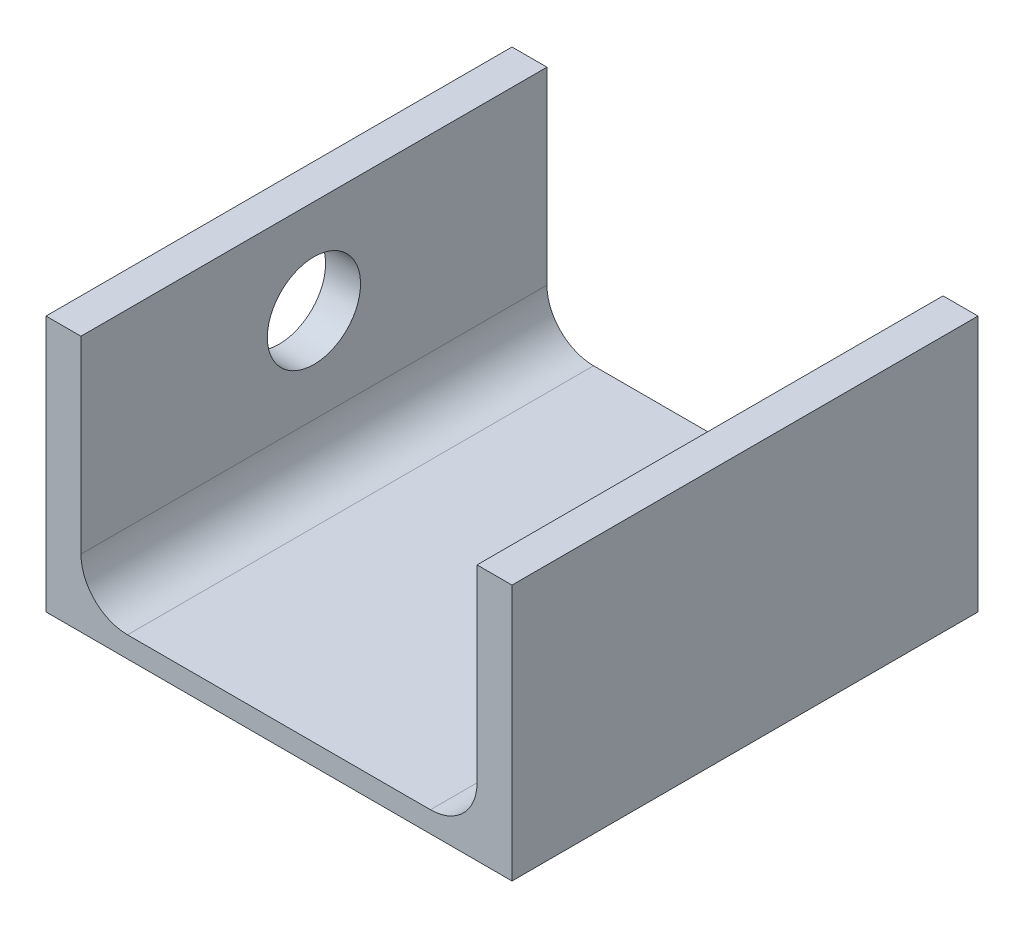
ISO-10303-21;
HEADER;
FILE_DESCRIPTION(('STEP AP214'),'2;1');
FILE_NAME('part.step','',(''),(''),'','','');
FILE_SCHEMA(('AUTOMOTIVE_DESIGN { 1 0 10303 214 1 1 1 1 }'));
ENDSEC;
DATA;
#1=APPLICATION_CONTEXT('core data for automotive mechanical design processes');
#2=APPLICATION_PROTOCOL_DEFINITION('international standard','automotive_design',2000,#1);
#3=PRODUCT_CONTEXT('',#1,'mechanical');
#4=PRODUCT('Part','Part','',(#3));
#5=PRODUCT_RELATED_PRODUCT_CATEGORY('part','',(#4));
#6=PRODUCT_DEFINITION_FORMATION('','',#4);
#7=PRODUCT_DEFINITION_CONTEXT('part definition',#1,'design');
#8=PRODUCT_DEFINITION('design','',#6,#7);
#9=PRODUCT_DEFINITION_SHAPE('','',#8);
#10=(LENGTH_UNIT() NAMED_UNIT(*) SI_UNIT(.MILLI.,.METRE.));
#11=(NAMED_UNIT(*) PLANE_ANGLE_UNIT() SI_UNIT($,.RADIAN.));
#12=(NAMED_UNIT(*) SI_UNIT($,.STERADIAN.) SOLID_ANGLE_UNIT());
#13=UNCERTAINTY_MEASURE_WITH_UNIT(LENGTH_MEASURE(1.E-05),#10,'distance_accuracy_value','');
#14=(GEOMETRIC_REPRESENTATION_CONTEXT(3) GLOBAL_UNCERTAINTY_ASSIGNED_CONTEXT((#13)) GLOBAL_UNIT_ASSIGNED_CONTEXT((#10,
#11,#12)) REPRESENTATION_CONTEXT('',''));
#15=CARTESIAN_POINT('',(0.,0.,0.));
#16=DIRECTION('',(0.,0.,1.));
#17=DIRECTION('',(1.,0.,0.));
#18=AXIS2_PLACEMENT_3D('',#15,#16,#17);
#19=CARTESIAN_POINT('',(0.,0.,100.));
#20=DIRECTION('',(0.,1.,0.));
#21=DIRECTION('',(0.,0.,1.));
#22=AXIS2_PLACEMENT_3D('',#19,#20,#21);
#23=PLANE('',#22);
#24=DIRECTION('',(1.,0.,0.));
#25=VECTOR('',#24,1.);
#26=CARTESIAN_POINT('',(0.,0.,0.));
#27=LINE('',#26,#25);
#28=CARTESIAN_POINT('',(0.,0.,0.));
#29=VERTEX_POINT('',#28);
#30=CARTESIAN_POINT('',(100.,0.,0.));
#31=VERTEX_POINT('',#30);
#32=EDGE_CURVE('E114',#29,#31,#27,.T.);
#33=ORIENTED_EDGE('',*,*,#32,.T.);
#34=DIRECTION('',(0.,0.,-1.));
#35=VECTOR('',#34,1.);
#36=CARTESIAN_POINT('',(100.,0.,100.));
#37=LINE('',#36,#35);
#38=CARTESIAN_POINT('',(100.,0.,100.));
#39=VERTEX_POINT('',#38);
#40=EDGE_CURVE('E11',#39,#31,#37,.T.);
#41=ORIENTED_EDGE('',*,*,#40,.F.);
#42=DIRECTION('',(1.,0.,0.));
#43=VECTOR('',#42,1.);
#44=CARTESIAN_POINT('',(0.,0.,100.));
#45=LINE('',#44,#43);
#46=CARTESIAN_POINT('',(0.,0.,100.));
#47=VERTEX_POINT('',#46);
#48=EDGE_CURVE('E150',#47,#39,#45,.T.);
#49=ORIENTED_EDGE('',*,*,#48,.F.);
#50=DIRECTION('',(0.,0.,-1.));
#51=VECTOR('',#50,1.);
#52=CARTESIAN_POINT('',(0.,0.,100.));
#53=LINE('',#52,#51);
#54=EDGE_CURVE('E46',#47,#29,#53,.T.);
#55=ORIENTED_EDGE('',*,*,#54,.T.);
#56=EDGE_LOOP('',(#33,#41,#49,#55));
#57=FACE_BOUND('',#56,.T.);
#58=ADVANCED_FACE('F32',(#57),#23,.F.);
#59=CARTESIAN_POINT('',(100.,0.,100.));
#60=DIRECTION('',(-1.,0.,0.));
#61=DIRECTION('',(0.,0.,1.));
#62=AXIS2_PLACEMENT_3D('',#59,#60,#61);
#63=PLANE('',#62);
#64=DIRECTION('',(0.,1.,0.));
#65=VECTOR('',#64,1.);
#66=CARTESIAN_POINT('',(100.,0.,0.));
#67=LINE('',#66,#65);
#68=CARTESIAN_POINT('',(100.,55.,0.));
#69=VERTEX_POINT('',#68);
#70=EDGE_CURVE('E110',#31,#69,#67,.T.);
#71=ORIENTED_EDGE('',*,*,#70,.T.);
#72=DIRECTION('',(0.,0.,-1.));
#73=VECTOR('',#72,1.);
#74=CARTESIAN_POINT('',(100.,55.,100.));
#75=LINE('',#74,#73);
#76=CARTESIAN_POINT('',(100.,55.,100.));
#77=VERTEX_POINT('',#76);
#78=EDGE_CURVE('E39',#77,#69,#75,.T.);
#79=ORIENTED_EDGE('',*,*,#78,.F.);
#80=DIRECTION('',(0.,1.,0.));
#81=VECTOR('',#80,1.);
#82=CARTESIAN_POINT('',(100.,0.,100.));
#83=LINE('',#82,#81);
#84=EDGE_CURVE('E123',#39,#77,#83,.T.);
#85=ORIENTED_EDGE('',*,*,#84,.F.);
#86=ORIENTED_EDGE('',*,*,#40,.T.);
#87=EDGE_LOOP('',(#71,#79,#85,#86));
#88=FACE_BOUND('',#87,.T.);
#89=ADVANCED_FACE('F122',(#88),#63,.F.);
#90=CARTESIAN_POINT('',(100.,55.,100.));
#91=DIRECTION('',(0.,-1.,0.));
#92=DIRECTION('',(0.,0.,-1.));
#93=AXIS2_PLACEMENT_3D('',#90,#91,#92);
#94=PLANE('',#93);
#95=DIRECTION('',(-1.,0.,0.));
#96=VECTOR('',#95,1.);
#97=CARTESIAN_POINT('',(100.,55.,0.));
#98=LINE('',#97,#96);
#99=CARTESIAN_POINT('',(92.5,55.,0.));
#100=VERTEX_POINT('',#99);
#101=EDGE_CURVE('E116',#69,#100,#98,.T.);
#102=ORIENTED_EDGE('',*,*,#101,.T.);
#103=DIRECTION('',(0.,0.,-1.));
#104=VECTOR('',#103,1.);
#105=CARTESIAN_POINT('',(92.5,55.,100.));
#106=LINE('',#105,#104);
#107=CARTESIAN_POINT('',(92.5,55.,100.));
#108=VERTEX_POINT('',#107);
#109=EDGE_CURVE('E185',#108,#100,#106,.T.);
#110=ORIENTED_EDGE('',*,*,#109,.F.);
#111=DIRECTION('',(-1.,0.,0.));
#112=VECTOR('',#111,1.);
#113=CARTESIAN_POINT('',(100.,55.,100.));
#114=LINE('',#113,#112);
#115=EDGE_CURVE('E153',#77,#108,#114,.T.);
#116=ORIENTED_EDGE('',*,*,#115,.F.);
#117=ORIENTED_EDGE('',*,*,#78,.T.);
#118=EDGE_LOOP('',(#102,#110,#116,#117));
#119=FACE_BOUND('',#118,.T.);
#120=ADVANCED_FACE('F189',(#119),#94,.F.);
#121=CARTESIAN_POINT('',(92.5,55.,100.));
#122=DIRECTION('',(1.,0.,0.));
#123=DIRECTION('',(0.,0.,-1.));
#124=AXIS2_PLACEMENT_3D('',#121,#122,#123);
#125=PLANE('',#124);
#126=DIRECTION('',(0.,-1.,0.));
#127=VECTOR('',#126,1.);
#128=CARTESIAN_POINT('',(92.5,55.,0.));
#129=LINE('',#128,#127);
#130=CARTESIAN_POINT('',(92.5,14.5000000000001,0.));
#131=VERTEX_POINT('',#130);
#132=EDGE_CURVE('E134',#100,#131,#129,.T.);
#133=ORIENTED_EDGE('',*,*,#132,.T.);
#134=DIRECTION('',(0.,0.,-1.));
#135=VECTOR('',#134,1.);
#136=CARTESIAN_POINT('',(92.5,14.5000000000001,100.));
#137=LINE('',#136,#135);
#138=CARTESIAN_POINT('',(92.5,14.5000000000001,100.));
#139=VERTEX_POINT('',#138);
#140=EDGE_CURVE('E182',#139,#131,#137,.T.);
#141=ORIENTED_EDGE('',*,*,#140,.F.);
#142=DIRECTION('',(0.,-1.,0.));
#143=VECTOR('',#142,1.);
#144=CARTESIAN_POINT('',(92.5,55.,100.));
#145=LINE('',#144,#143);
#146=EDGE_CURVE('E155',#108,#139,#145,.T.);
#147=ORIENTED_EDGE('',*,*,#146,.F.);
#148=ORIENTED_EDGE('',*,*,#109,.T.);
#149=EDGE_LOOP('',(#133,#141,#147,#148));
#150=FACE_BOUND('',#149,.T.);
#151=ADVANCED_FACE('F219',(#150),#125,.F.);
#152=CARTESIAN_POINT('',(82.5,14.5,100.));
#153=DIRECTION('',(0.,0.,-1.));
#154=DIRECTION('',(-1.,0.,0.));
#155=AXIS2_PLACEMENT_3D('',#152,#153,#154);
#156=CYLINDRICAL_SURFACE('',#155,10.);
#157=CARTESIAN_POINT('',(82.5,14.5,0.));
#158=DIRECTION('',(0.,0.,-1.));
#159=DIRECTION('',(-1.,0.,0.));
#160=AXIS2_PLACEMENT_3D('',#157,#158,#159);
#161=CIRCLE('',#160,10.);
#162=CARTESIAN_POINT('',(82.4999999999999,4.5,0.));
#163=VERTEX_POINT('',#162);
#164=EDGE_CURVE('E136',#131,#163,#161,.T.);
#165=ORIENTED_EDGE('',*,*,#164,.T.);
#166=DIRECTION('',(0.,0.,-1.));
#167=VECTOR('',#166,1.);
#168=CARTESIAN_POINT('',(82.4999999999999,4.5,100.));
#169=LINE('',#168,#167);
#170=CARTESIAN_POINT('',(82.4999999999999,4.5,100.));
#171=VERTEX_POINT('',#170);
#172=EDGE_CURVE('E179',#171,#163,#169,.T.);
#173=ORIENTED_EDGE('',*,*,#172,.F.);
#174=CARTESIAN_POINT('',(82.5,14.5,100.));
#175=DIRECTION('',(0.,0.,-1.));
#176=DIRECTION('',(-1.,0.,0.));
#177=AXIS2_PLACEMENT_3D('',#174,#175,#176);
#178=CIRCLE('',#177,10.);
#179=EDGE_CURVE('E157',#139,#171,#178,.T.);
#180=ORIENTED_EDGE('',*,*,#179,.F.);
#181=ORIENTED_EDGE('',*,*,#140,.T.);
#182=EDGE_LOOP('',(#165,#173,#180,#181));
#183=FACE_BOUND('',#182,.T.);
#184=ADVANCED_FACE('F216',(#183),#156,.F.);
#185=CARTESIAN_POINT('',(82.4999999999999,4.5,100.));
#186=DIRECTION('',(0.,-1.,0.));
#187=DIRECTION('',(1.,0.,0.));
#188=AXIS2_PLACEMENT_3D('',#185,#186,#187);
#189=PLANE('',#188);
#190=DIRECTION('',(-1.,0.,0.));
#191=VECTOR('',#190,1.);
#192=CARTESIAN_POINT('',(82.4999999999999,4.5,0.));
#193=LINE('',#192,#191);
#194=CARTESIAN_POINT('',(17.5000000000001,4.49999999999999,0.));
#195=VERTEX_POINT('',#194);
#196=EDGE_CURVE('E138',#163,#195,#193,.T.);
#197=ORIENTED_EDGE('',*,*,#196,.T.);
#198=DIRECTION('',(0.,0.,-1.));
#199=VECTOR('',#198,1.);
#200=CARTESIAN_POINT('',(17.5000000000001,4.49999999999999,100.));
#201=LINE('',#200,#199);
#202=CARTESIAN_POINT('',(17.5000000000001,4.49999999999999,100.));
#203=VERTEX_POINT('',#202);
#204=EDGE_CURVE('E176',#203,#195,#201,.T.);
#205=ORIENTED_EDGE('',*,*,#204,.F.);
#206=DIRECTION('',(-1.,0.,0.));
#207=VECTOR('',#206,1.);
#208=CARTESIAN_POINT('',(82.4999999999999,4.5,100.));
#209=LINE('',#208,#207);
#210=EDGE_CURVE('E159',#171,#203,#209,.T.);
#211=ORIENTED_EDGE('',*,*,#210,.F.);
#212=ORIENTED_EDGE('',*,*,#172,.T.);
#213=EDGE_LOOP('',(#197,#205,#211,#212));
#214=FACE_BOUND('',#213,.T.);
#215=ADVANCED_FACE('F212',(#214),#189,.F.);
#216=CARTESIAN_POINT('',(17.5,14.5,100.));
#217=DIRECTION('',(0.,0.,-1.));
#218=DIRECTION('',(-1.,0.,0.));
#219=AXIS2_PLACEMENT_3D('',#216,#217,#218);
#220=CYLINDRICAL_SURFACE('',#219,10.);
#221=CARTESIAN_POINT('',(17.5,14.5,0.));
#222=DIRECTION('',(0.,0.,-1.));
#223=DIRECTION('',(-1.,0.,0.));
#224=AXIS2_PLACEMENT_3D('',#221,#222,#223);
#225=CIRCLE('',#224,10.);
#226=CARTESIAN_POINT('',(7.50000000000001,14.5000000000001,0.));
#227=VERTEX_POINT('',#226);
#228=EDGE_CURVE('E140',#195,#227,#225,.T.);
#229=ORIENTED_EDGE('',*,*,#228,.T.);
#230=DIRECTION('',(0.,0.,-1.));
#231=VECTOR('',#230,1.);
#232=CARTESIAN_POINT('',(7.50000000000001,14.5000000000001,100.));
#233=LINE('',#232,#231);
#234=CARTESIAN_POINT('',(7.50000000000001,14.5000000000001,100.));
#235=VERTEX_POINT('',#234);
#236=EDGE_CURVE('E173',#235,#227,#233,.T.);
#237=ORIENTED_EDGE('',*,*,#236,.F.);
#238=CARTESIAN_POINT('',(17.5,14.5,100.));
#239=DIRECTION('',(0.,0.,-1.));
#240=DIRECTION('',(-1.,0.,0.));
#241=AXIS2_PLACEMENT_3D('',#238,#239,#240);
#242=CIRCLE('',#241,10.);
#243=EDGE_CURVE('E161',#203,#235,#242,.T.);
#244=ORIENTED_EDGE('',*,*,#243,.F.);
#245=ORIENTED_EDGE('',*,*,#204,.T.);
#246=EDGE_LOOP('',(#229,#237,#244,#245));
#247=FACE_BOUND('',#246,.T.);
#248=ADVANCED_FACE('F208',(#247),#220,.F.);
#249=CARTESIAN_POINT('',(7.50000000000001,14.5000000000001,100.));
#250=DIRECTION('',(-1.,0.,0.));
#251=DIRECTION('',(0.,-1.,0.));
#252=AXIS2_PLACEMENT_3D('',#249,#250,#251);
#253=PLANE('',#252);
#254=CARTESIAN_POINT('',(7.5,34.75,50.));
#255=DIRECTION('',(-1.,0.,0.));
#256=DIRECTION('',(0.,-1.,0.));
#257=AXIS2_PLACEMENT_3D('',#254,#255,#256);
#258=CIRCLE('',#257,10.);
#259=CARTESIAN_POINT('',(7.5,24.75,50.));
#260=VERTEX_POINT('',#259);
#261=EDGE_CURVE('E126',#260,#260,#258,.T.);
#262=ORIENTED_EDGE('',*,*,#261,.T.);
#263=EDGE_LOOP('',(#262));
#264=FACE_BOUND('',#263,.T.);
#265=DIRECTION('',(0.,1.,0.));
#266=VECTOR('',#265,1.);
#267=CARTESIAN_POINT('',(7.50000000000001,14.5000000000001,0.));
#268=LINE('',#267,#266);
#269=CARTESIAN_POINT('',(7.5,55.,0.));
#270=VERTEX_POINT('',#269);
#271=EDGE_CURVE('E142',#227,#270,#268,.T.);
#272=ORIENTED_EDGE('',*,*,#271,.T.);
#273=DIRECTION('',(0.,0.,-1.));
#274=VECTOR('',#273,1.);
#275=CARTESIAN_POINT('',(7.5,55.,100.));
#276=LINE('',#275,#274);
#277=CARTESIAN_POINT('',(7.5,55.,100.));
#278=VERTEX_POINT('',#277);
#279=EDGE_CURVE('E171',#278,#270,#276,.T.);
#280=ORIENTED_EDGE('',*,*,#279,.F.);
#281=DIRECTION('',(0.,1.,0.));
#282=VECTOR('',#281,1.);
#283=CARTESIAN_POINT('',(7.50000000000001,14.5000000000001,100.));
#284=LINE('',#283,#282);
#285=EDGE_CURVE('E163',#235,#278,#284,.T.);
#286=ORIENTED_EDGE('',*,*,#285,.F.);
#287=ORIENTED_EDGE('',*,*,#236,.T.);
#288=EDGE_LOOP('',(#272,#280,#286,#287));
#289=FACE_BOUND('',#288,.T.);
#290=ADVANCED_FACE('F203',(#264,#289),#253,.F.);
#291=CARTESIAN_POINT('',(0.,55.,100.));
#292=DIRECTION('',(0.,1.,0.));
#293=DIRECTION('',(0.,0.,1.));
#294=AXIS2_PLACEMENT_3D('',#291,#292,#293);
#295=PLANE('',#294);
#296=DIRECTION('',(1.,0.,0.));
#297=VECTOR('',#296,1.);
#298=CARTESIAN_POINT('',(0.,55.,0.));
#299=LINE('',#298,#297);
#300=CARTESIAN_POINT('',(0.,55.,0.));
#301=VERTEX_POINT('',#300);
#302=EDGE_CURVE('E145',#301,#270,#299,.T.);
#303=ORIENTED_EDGE('',*,*,#302,.F.);
#304=DIRECTION('',(0.,0.,-1.));
#305=VECTOR('',#304,1.);
#306=CARTESIAN_POINT('',(0.,55.,100.));
#307=LINE('',#306,#305);
#308=CARTESIAN_POINT('',(0.,55.,100.));
#309=VERTEX_POINT('',#308);
#310=EDGE_CURVE('E54',#309,#301,#307,.T.);
#311=ORIENTED_EDGE('',*,*,#310,.F.);
#312=DIRECTION('',(1.,0.,0.));
#313=VECTOR('',#312,1.);
#314=CARTESIAN_POINT('',(0.,55.,100.));
#315=LINE('',#314,#313);
#316=EDGE_CURVE('E165',#309,#278,#315,.T.);
#317=ORIENTED_EDGE('',*,*,#316,.T.);
#318=ORIENTED_EDGE('',*,*,#279,.T.);
#319=EDGE_LOOP('',(#303,#311,#317,#318));
#320=FACE_BOUND('',#319,.T.);
#321=ADVANCED_FACE('F197',(#320),#295,.T.);
#322=CARTESIAN_POINT('',(0.,0.,100.));
#323=DIRECTION('',(-1.,0.,0.));
#324=DIRECTION('',(0.,0.,1.));
#325=AXIS2_PLACEMENT_3D('',#322,#323,#324);
#326=PLANE('',#325);
#327=CARTESIAN_POINT('',(0.,34.75,50.));
#328=DIRECTION('',(-1.,0.,0.));
#329=DIRECTION('',(0.,0.,1.));
#330=AXIS2_PLACEMENT_3D('',#327,#328,#329);
#331=CIRCLE('',#330,10.);
#332=CARTESIAN_POINT('',(0.,34.75,60.));
#333=VERTEX_POINT('',#332);
#334=EDGE_CURVE('E129',#333,#333,#331,.T.);
#335=ORIENTED_EDGE('',*,*,#334,.F.);
#336=EDGE_LOOP('',(#335));
#337=FACE_BOUND('',#336,.T.);
#338=DIRECTION('',(0.,1.,0.));
#339=VECTOR('',#338,1.);
#340=CARTESIAN_POINT('',(0.,0.,0.));
#341=LINE('',#340,#339);
#342=EDGE_CURVE('E148',#29,#301,#341,.T.);
#343=ORIENTED_EDGE('',*,*,#342,.F.);
#344=ORIENTED_EDGE('',*,*,#54,.F.);
#345=DIRECTION('',(0.,1.,0.));
#346=VECTOR('',#345,1.);
#347=CARTESIAN_POINT('',(0.,0.,100.));
#348=LINE('',#347,#346);
#349=EDGE_CURVE('E167',#47,#309,#348,.T.);
#350=ORIENTED_EDGE('',*,*,#349,.T.);
#351=ORIENTED_EDGE('',*,*,#310,.T.);
#352=EDGE_LOOP('',(#343,#344,#350,#351));
#353=FACE_BOUND('',#352,.T.);
#354=ADVANCED_FACE('F196',(#337,#353),#326,.T.);
#355=CARTESIAN_POINT('',(82.5,14.5,100.));
#356=DIRECTION('',(0.,0.,-1.));
#357=DIRECTION('',(-1.,0.,0.));
#358=AXIS2_PLACEMENT_3D('',#355,#356,#357);
#359=PLANE('',#358);
#360=ORIENTED_EDGE('',*,*,#48,.T.);
#361=ORIENTED_EDGE('',*,*,#84,.T.);
#362=ORIENTED_EDGE('',*,*,#115,.T.);
#363=ORIENTED_EDGE('',*,*,#146,.T.);
#364=ORIENTED_EDGE('',*,*,#179,.T.);
#365=ORIENTED_EDGE('',*,*,#210,.T.);
#366=ORIENTED_EDGE('',*,*,#243,.T.);
#367=ORIENTED_EDGE('',*,*,#285,.T.);
#368=ORIENTED_EDGE('',*,*,#316,.F.);
#369=ORIENTED_EDGE('',*,*,#349,.F.);
#370=EDGE_LOOP('',(#360,#361,#362,#363,#364,#365,#366,#367,#368,#369));
#371=FACE_BOUND('',#370,.T.);
#372=ADVANCED_FACE('F193',(#371),#359,.F.);
#373=CARTESIAN_POINT('',(82.5,14.5,0.));
#374=DIRECTION('',(0.,0.,-1.));
#375=DIRECTION('',(-1.,0.,0.));
#376=AXIS2_PLACEMENT_3D('',#373,#374,#375);
#377=PLANE('',#376);
#378=ORIENTED_EDGE('',*,*,#32,.F.);
#379=ORIENTED_EDGE('',*,*,#342,.T.);
#380=ORIENTED_EDGE('',*,*,#302,.T.);
#381=ORIENTED_EDGE('',*,*,#271,.F.);
#382=ORIENTED_EDGE('',*,*,#228,.F.);
#383=ORIENTED_EDGE('',*,*,#196,.F.);
#384=ORIENTED_EDGE('',*,*,#164,.F.);
#385=ORIENTED_EDGE('',*,*,#132,.F.);
#386=ORIENTED_EDGE('',*,*,#101,.F.);
#387=ORIENTED_EDGE('',*,*,#70,.F.);
#388=EDGE_LOOP('',(#378,#379,#380,#381,#382,#383,#384,#385,#386,#387));
#389=FACE_BOUND('',#388,.T.);
#390=ADVANCED_FACE('F111',(#389),#377,.T.);
#391=CARTESIAN_POINT('',(10.,34.75,50.));
#392=DIRECTION('',(-1.,0.,0.));
#393=DIRECTION('',(0.,0.,1.));
#394=AXIS2_PLACEMENT_3D('',#391,#392,#393);
#395=CYLINDRICAL_SURFACE('',#394,10.);
#396=ORIENTED_EDGE('',*,*,#334,.T.);
#397=EDGE_LOOP('',(#396));
#398=FACE_BOUND('',#397,.T.);
#399=ORIENTED_EDGE('',*,*,#261,.F.);
#400=EDGE_LOOP('',(#399));
#401=FACE_BOUND('',#400,.T.);
#402=ADVANCED_FACE('F293',(#398,#401),#395,.F.);
#403=CLOSED_SHELL('',(#58,#89,#120,#151,#184,#215,#248,#290,#321,#354,#372,#390,#402));
#404=MANIFOLD_SOLID_BREP('B2',#403);
#405=ADVANCED_BREP_SHAPE_REPRESENTATION('',(#18,#404),#14);
#406=SHAPE_DEFINITION_REPRESENTATION(#9,#405);
ENDSEC;
END-ISO-10303-21;
